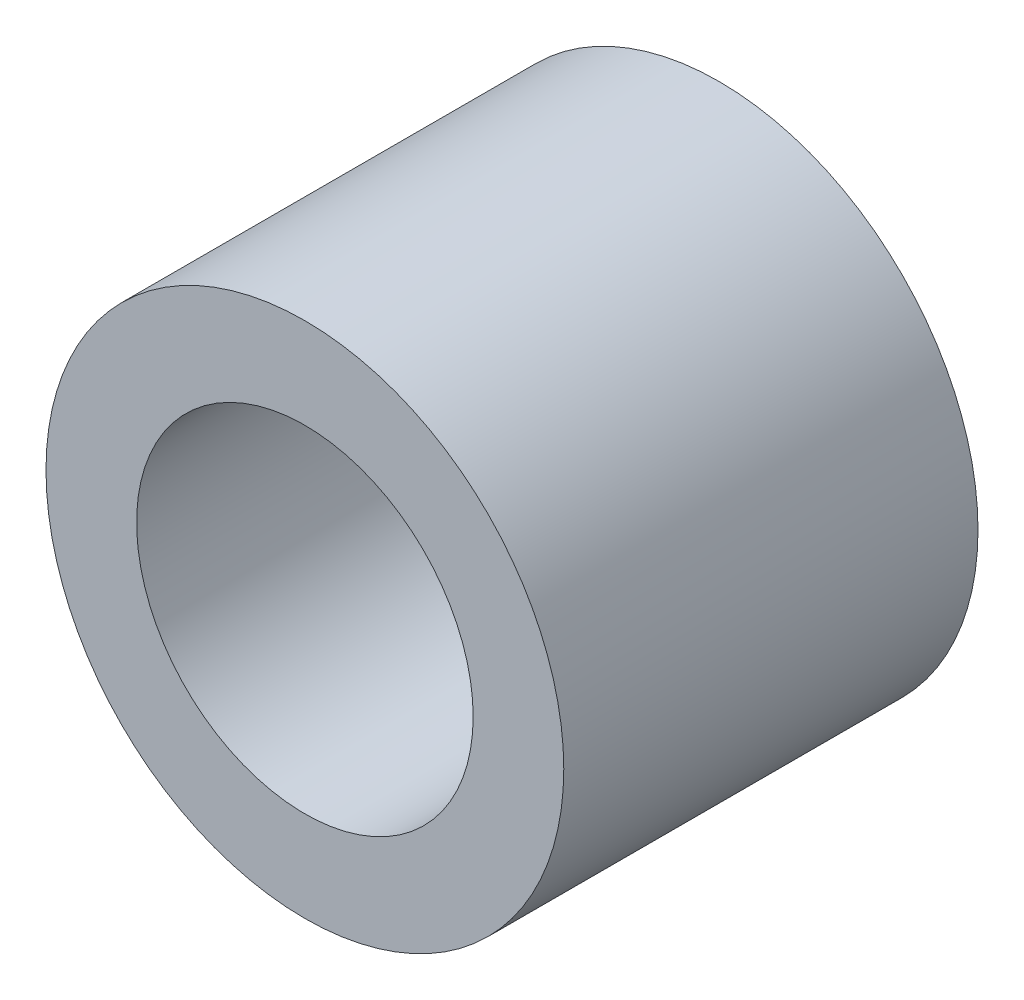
ISO-10303-21;
HEADER;
FILE_DESCRIPTION(('STEP AP214'),'2;1');
FILE_NAME('part.step','',(''),(''),'','','');
FILE_SCHEMA(('AUTOMOTIVE_DESIGN { 1 0 10303 214 1 1 1 1 }'));
ENDSEC;
DATA;
#1=APPLICATION_CONTEXT('core data for automotive mechanical design processes');
#2=APPLICATION_PROTOCOL_DEFINITION('international standard','automotive_design',2000,#1);
#3=PRODUCT_CONTEXT('',#1,'mechanical');
#4=PRODUCT('Part','Part','',(#3));
#5=PRODUCT_RELATED_PRODUCT_CATEGORY('part','',(#4));
#6=PRODUCT_DEFINITION_FORMATION('','',#4);
#7=PRODUCT_DEFINITION_CONTEXT('part definition',#1,'design');
#8=PRODUCT_DEFINITION('design','',#6,#7);
#9=PRODUCT_DEFINITION_SHAPE('','',#8);
#10=(LENGTH_UNIT() NAMED_UNIT(*) SI_UNIT(.MILLI.,.METRE.));
#11=(NAMED_UNIT(*) PLANE_ANGLE_UNIT() SI_UNIT($,.RADIAN.));
#12=(NAMED_UNIT(*) SI_UNIT($,.STERADIAN.) SOLID_ANGLE_UNIT());
#13=UNCERTAINTY_MEASURE_WITH_UNIT(LENGTH_MEASURE(1.E-05),#10,'distance_accuracy_value','');
#14=(GEOMETRIC_REPRESENTATION_CONTEXT(3) GLOBAL_UNCERTAINTY_ASSIGNED_CONTEXT((#13)) GLOBAL_UNIT_ASSIGNED_CONTEXT((#10,
#11,#12)) REPRESENTATION_CONTEXT('',''));
#15=CARTESIAN_POINT('',(0.,0.,0.));
#16=DIRECTION('',(0.,0.,1.));
#17=DIRECTION('',(1.,0.,0.));
#18=AXIS2_PLACEMENT_3D('',#15,#16,#17);
#19=CARTESIAN_POINT('',(0.,0.,32.));
#20=DIRECTION('',(0.,0.,1.));
#21=DIRECTION('',(1.,0.,0.));
#22=AXIS2_PLACEMENT_3D('',#19,#20,#21);
#23=PLANE('',#22);
#24=CARTESIAN_POINT('',(0.,0.,32.));
#25=DIRECTION('',(0.,0.,1.));
#26=DIRECTION('',(1.,0.,0.));
#27=AXIS2_PLACEMENT_3D('',#24,#25,#26);
#28=CIRCLE('',#27,20.);
#29=CARTESIAN_POINT('',(20.,0.,32.));
#30=VERTEX_POINT('',#29);
#31=EDGE_CURVE('E10',#30,#30,#28,.T.);
#32=ORIENTED_EDGE('',*,*,#31,.T.);
#33=EDGE_LOOP('',(#32));
#34=FACE_BOUND('',#33,.T.);
#35=CARTESIAN_POINT('',(0.,0.,32.));
#36=DIRECTION('',(0.,0.,1.));
#37=DIRECTION('',(1.,0.,0.));
#38=AXIS2_PLACEMENT_3D('',#35,#36,#37);
#39=CIRCLE('',#38,13.);
#40=CARTESIAN_POINT('',(13.,0.,32.));
#41=VERTEX_POINT('',#40);
#42=EDGE_CURVE('E38',#41,#41,#39,.T.);
#43=ORIENTED_EDGE('',*,*,#42,.F.);
#44=EDGE_LOOP('',(#43));
#45=FACE_BOUND('',#44,.T.);
#46=ADVANCED_FACE('F27',(#34,#45),#23,.T.);
#47=CARTESIAN_POINT('',(0.,0.,0.));
#48=DIRECTION('',(0.,0.,1.));
#49=DIRECTION('',(1.,0.,0.));
#50=AXIS2_PLACEMENT_3D('',#47,#48,#49);
#51=PLANE('',#50);
#52=CARTESIAN_POINT('',(0.,0.,0.));
#53=DIRECTION('',(0.,0.,1.));
#54=DIRECTION('',(1.,0.,0.));
#55=AXIS2_PLACEMENT_3D('',#52,#53,#54);
#56=CIRCLE('',#55,20.);
#57=CARTESIAN_POINT('',(20.,0.,0.));
#58=VERTEX_POINT('',#57);
#59=EDGE_CURVE('E34',#58,#58,#56,.T.);
#60=ORIENTED_EDGE('',*,*,#59,.F.);
#61=EDGE_LOOP('',(#60));
#62=FACE_BOUND('',#61,.T.);
#63=CARTESIAN_POINT('',(0.,0.,0.));
#64=DIRECTION('',(0.,0.,1.));
#65=DIRECTION('',(1.,0.,0.));
#66=AXIS2_PLACEMENT_3D('',#63,#64,#65);
#67=CIRCLE('',#66,13.);
#68=CARTESIAN_POINT('',(13.,0.,0.));
#69=VERTEX_POINT('',#68);
#70=EDGE_CURVE('E42',#69,#69,#67,.T.);
#71=ORIENTED_EDGE('',*,*,#70,.T.);
#72=EDGE_LOOP('',(#71));
#73=FACE_BOUND('',#72,.T.);
#74=ADVANCED_FACE('F48',(#62,#73),#51,.F.);
#75=CARTESIAN_POINT('',(0.,0.,32.));
#76=DIRECTION('',(0.,0.,-1.));
#77=DIRECTION('',(-1.,0.,0.));
#78=AXIS2_PLACEMENT_3D('',#75,#76,#77);
#79=CYLINDRICAL_SURFACE('',#78,20.);
#80=ORIENTED_EDGE('',*,*,#31,.F.);
#81=EDGE_LOOP('',(#80));
#82=FACE_BOUND('',#81,.T.);
#83=ORIENTED_EDGE('',*,*,#59,.T.);
#84=EDGE_LOOP('',(#83));
#85=FACE_BOUND('',#84,.T.);
#86=ADVANCED_FACE('F29',(#82,#85),#79,.T.);
#87=CARTESIAN_POINT('',(0.,0.,32.));
#88=DIRECTION('',(0.,0.,-1.));
#89=DIRECTION('',(-1.,0.,0.));
#90=AXIS2_PLACEMENT_3D('',#87,#88,#89);
#91=CYLINDRICAL_SURFACE('',#90,13.);
#92=ORIENTED_EDGE('',*,*,#42,.T.);
#93=EDGE_LOOP('',(#92));
#94=FACE_BOUND('',#93,.T.);
#95=ORIENTED_EDGE('',*,*,#70,.F.);
#96=EDGE_LOOP('',(#95));
#97=FACE_BOUND('',#96,.T.);
#98=ADVANCED_FACE('F50',(#94,#97),#91,.F.);
#99=CLOSED_SHELL('',(#46,#74,#86,#98));
#100=MANIFOLD_SOLID_BREP('B2',#99);
#101=ADVANCED_BREP_SHAPE_REPRESENTATION('',(#18,#100),#14);
#102=SHAPE_DEFINITION_REPRESENTATION(#9,#101);
ENDSEC;
END-ISO-10303-21;
